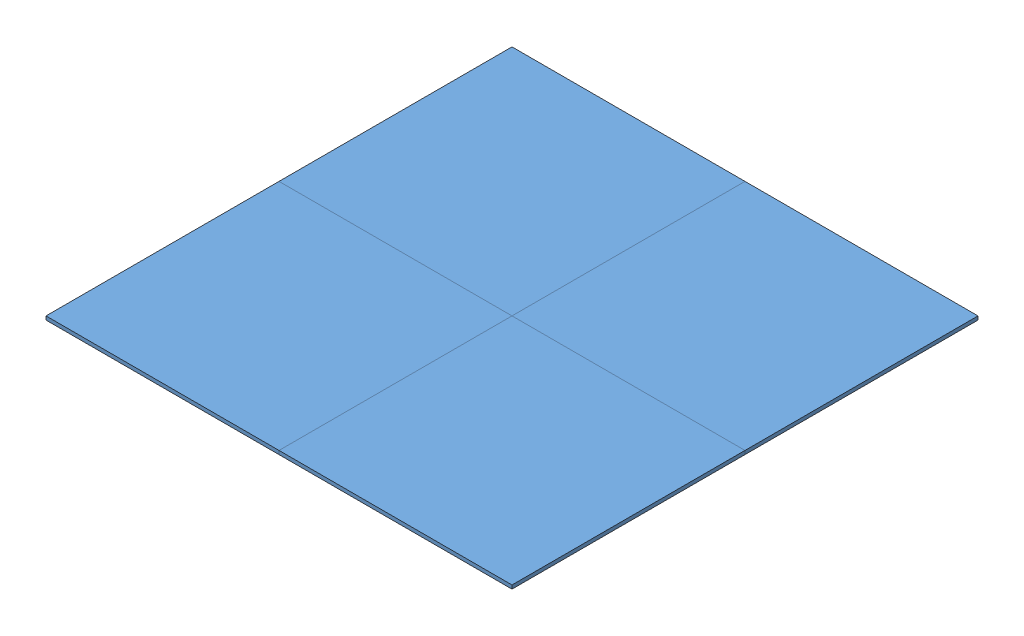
SolidWorks assembly 4 4x4 Particle Board.SLDASM, configuration Default (file format 9000). Lengths in mm.
Overall size (2438.4 19.05 2438.4).
4 component instances, 1 part files, 7 mates.
Components (placement in the parent):
- Particle board-1: Particle board.SLDPRT [Default] at (-851.6262 679.1206 1589.7791) size (1219.2 19.05 1219.2)
- Particle board-2: Particle board.SLDPRT [Default] at (367.5738 679.1206 1589.7791) size (1219.2 19.05 1219.2)
- Particle board-3: Particle board.SLDPRT [Default] at (-851.6262 679.1206 370.5791) size (1219.2 19.05 1219.2)
- Particle board-4: Particle board.SLDPRT [Default] at (367.5738 679.1206 370.5791) size (1219.2 19.05 1219.2)
Mates (geometry in assembly coordinates):
- Coincident1: coincident anti-aligned: plane of Particle board-3 through (-242.0262 698.1706 980.1791) normal (1 0 0); plane of Particle board-4 through (-242.0262 698.1706 980.1791) normal (-1 0 0)
- Coincident2: coincident aligned: line of Particle board-3 through (-242.0262 698.1706 980.1791) axis (0 -1 0); line of Particle board-4 through (-242.0262 698.1706 980.1791) axis (0 -1 0)
- Coincident5: coincident anti-aligned: line of Particle board-3 through (-242.0262 679.1206 980.1791) axis (0 0 -1); line of Particle board-4 through (-242.0262 679.1206 -239.0209) axis (0 0 1)
- Coincident6: coincident anti-aligned: line of Particle board-1 through (-242.0262 698.1706 980.1791) axis (-1 0 0); line of Particle board-3 through (-1461.2262 698.1706 980.1791) axis (1 0 0)
- Coincident7: coincident anti-aligned: line of Particle board-1 through (-242.0262 698.1706 2199.3791) axis (0 0 -1); line of Particle board-2 through (-242.0262 698.1706 980.1791) axis (0 0 1)
- Coincident8: coincident: plane of Particle board-1 through (-1461.2262 698.1706 2199.3791) normal (0 0 1); line of Particle board-2 through (-242.0262 698.1706 2199.3791) axis (0 -1 0)
- Coincident9: coincident aligned: line of Particle board-2 through (977.1738 698.1706 980.1791) axis (0 -1 0); line of Particle board-4 through (977.1738 698.1706 980.1791) axis (0 -1 0)
